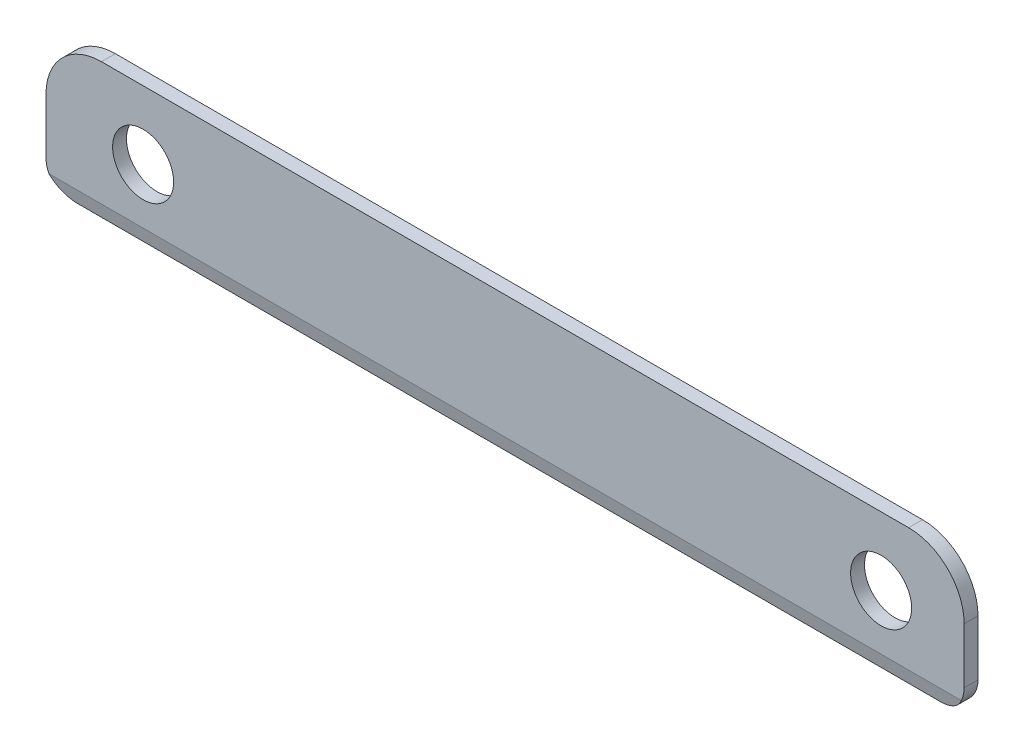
from build123d import *

# Parameters (mm, degrees)
SZKIC1_R                    = 11
DODANIE_WYCI_GNI_CIE1_DEPTH = 5
WYTNIJ_WYCI_GNI_CIE1_DEPTH  = 332.951654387


with BuildPart() as part:
    # Szkic1 → Dodanie-wyci_gni_cie1 (new body)
    with BuildSketch(Plane.XY):
        with BuildLine():
            Line((-165.073622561, -15.683227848), (-165.073622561, 4.316772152))
            ThreePointArc((-165.073622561, 4.316772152), (-159.215758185, 18.458907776), (-145.073622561, 24.316772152))
            Line((-145.073622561, 24.316772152), (145.845208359, 24.316772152))
            ThreePointArc((145.845208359, 24.316772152), (159.987343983, 18.458907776), (165.845208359, 4.316772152))
            Line((165.845208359, 4.316772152), (165.845208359, -15.683227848))
            ThreePointArc((165.845208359, -15.683227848), (162.916276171, -22.75429566), (155.845208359, -25.683227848))
            Line((155.845208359, -25.683227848), (-155.073622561, -25.683227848))
            ThreePointArc((-155.073622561, -25.683227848), (-162.144690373, -22.75429566), (-165.073622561, -15.683227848))
        make_face()
        with Locations((-130.073622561, -0.263085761)):
            Circle(SZKIC1_R, mode=Mode.SUBTRACT)
        with Locations((135.926377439, -0.263085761)):
            Circle(SZKIC1_R, mode=Mode.SUBTRACT)
    extrude(amount=DODANIE_WYCI_GNI_CIE1_DEPTH)

    # Szkic2 → Wytnij-wyci_gni_cie1 (cut, through all)
    with BuildSketch(Plane.ZY.offset(165.073622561)):
        Polygon((5, -20.109128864), (3.578049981, -25.683227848), (5, -25.683227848), align=None)
    extrude(amount=-WYTNIJ_WYCI_GNI_CIE1_DEPTH, mode=Mode.SUBTRACT)


solid = part.part
